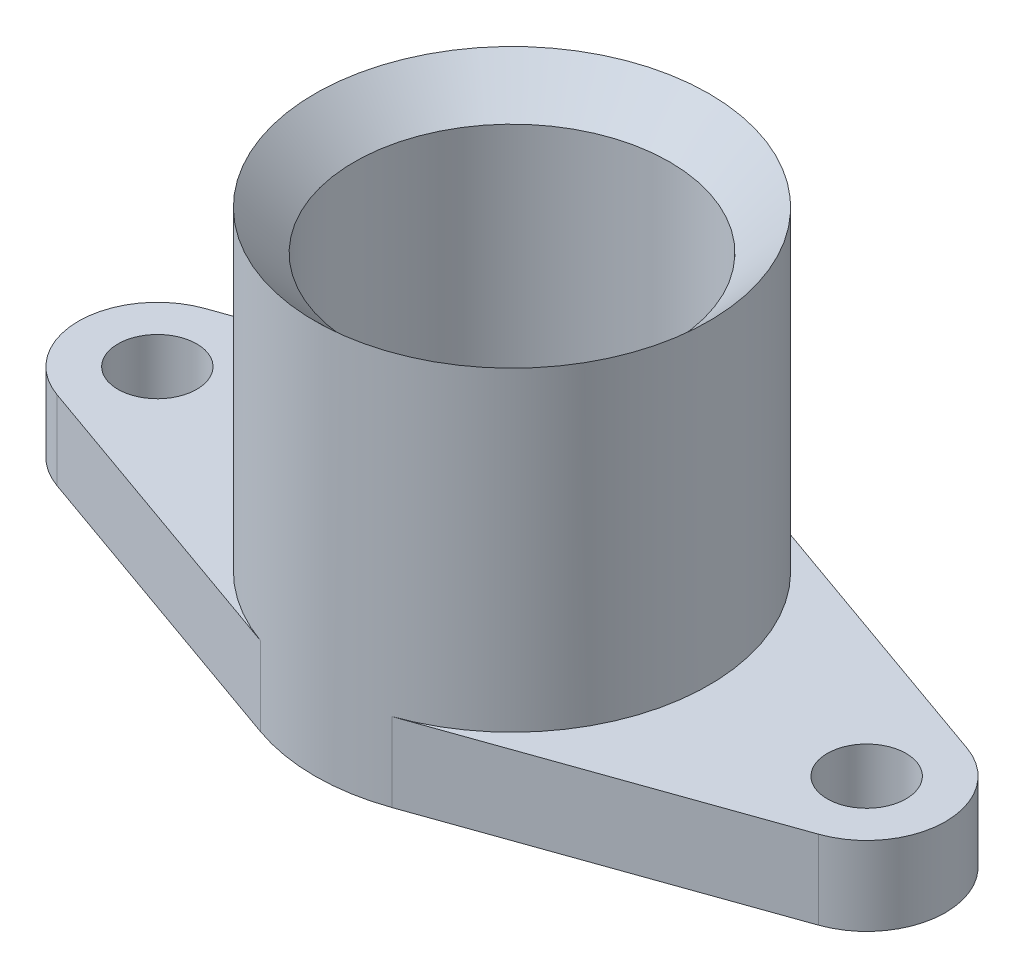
from build123d import *

# Parameters (mm, degrees)
EXTRUDE1_START = -20
SKETCH2_R      = 10
EXTRUDE1_DEPTH = 20


with BuildPart() as part:
    # Sketch1 → Revolve1 (revolve)
    with BuildSketch(Plane.XY, mode=Mode.PRIVATE) as revolve1_sk:
        Polygon((-50, 0), (-50, 100), (-40, 90), (-40, 0), align=None)
    revolve(revolve1_sk.sketch.rotate(Axis((0, -73.061494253, 0), (0, 1, 0)), 270), axis=Axis((0, -73.061494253, 0), (0, 1, 0)))

    # Sketch2 → Extrude1 (add)
    with BuildSketch(Plane.XZ.offset(EXTRUDE1_START)):
        with BuildLine():
            Line((-16.666666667, 47.140452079), (-96.666666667, 18.856180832))
            ThreePointArc((-96.666666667, 18.856180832), (-110, 0), (-96.666666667, -18.856180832))
            Line((-96.666666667, -18.856180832), (-16.666666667, -47.140452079))
            ThreePointArc((-16.666666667, -47.140452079), (-50, 0), (-16.666666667, 47.140452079))
        make_face()
        with Locations(Location((-90, 0, 0), (0, 0, 270))):
            Circle(SKETCH2_R, mode=Mode.SUBTRACT)
    extrude1 = extrude(amount=EXTRUDE1_DEPTH)

    # Mirror1: Extrude1 across plane
    add(extrude1.mirror(Plane(origin=(0, 0, 0), x_dir=(0, 0, 1), z_dir=(1, 0, 0))))


solid = part.part
